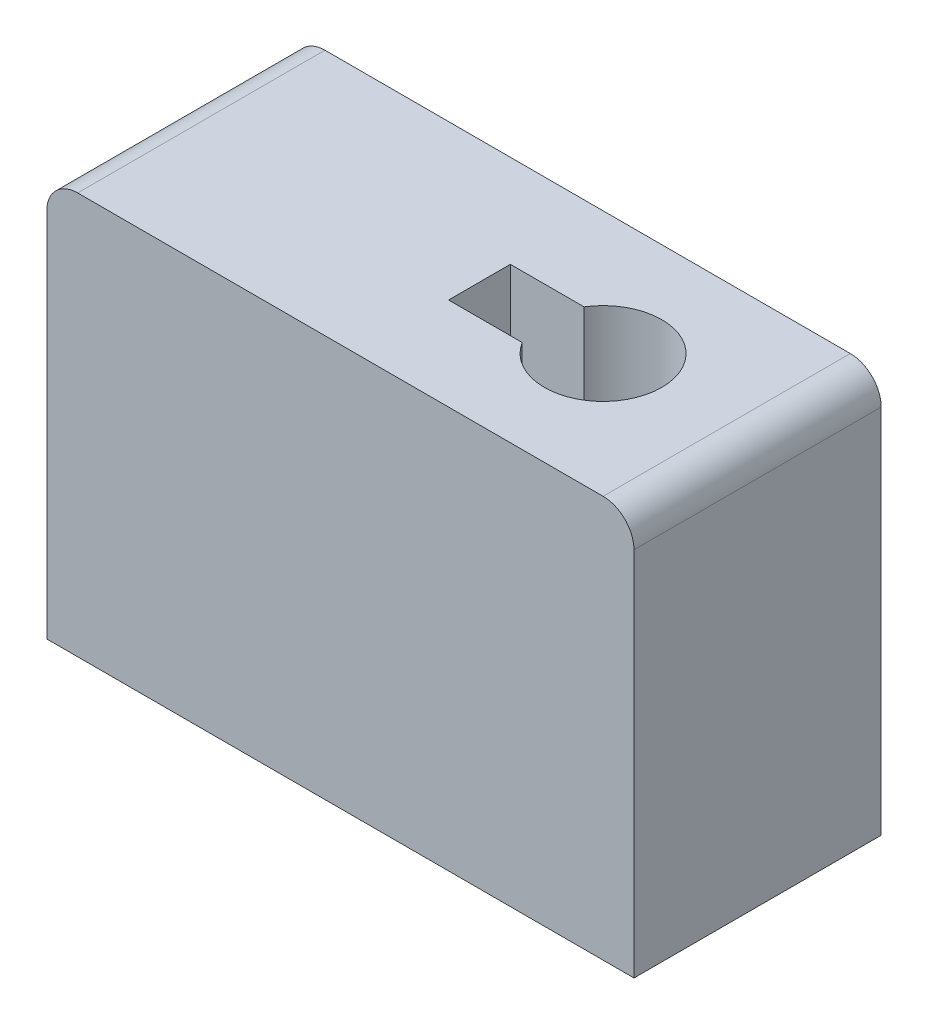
ISO-10303-21;
HEADER;
FILE_DESCRIPTION(('STEP AP214'),'2;1');
FILE_NAME('part.step','',(''),(''),'','','');
FILE_SCHEMA(('AUTOMOTIVE_DESIGN { 1 0 10303 214 1 1 1 1 }'));
ENDSEC;
DATA;
#1=APPLICATION_CONTEXT('core data for automotive mechanical design processes');
#2=APPLICATION_PROTOCOL_DEFINITION('international standard','automotive_design',2000,#1);
#3=PRODUCT_CONTEXT('',#1,'mechanical');
#4=PRODUCT('Part','Part','',(#3));
#5=PRODUCT_RELATED_PRODUCT_CATEGORY('part','',(#4));
#6=PRODUCT_DEFINITION_FORMATION('','',#4);
#7=PRODUCT_DEFINITION_CONTEXT('part definition',#1,'design');
#8=PRODUCT_DEFINITION('design','',#6,#7);
#9=PRODUCT_DEFINITION_SHAPE('','',#8);
#10=(LENGTH_UNIT() NAMED_UNIT(*) SI_UNIT(.MILLI.,.METRE.));
#11=(NAMED_UNIT(*) PLANE_ANGLE_UNIT() SI_UNIT($,.RADIAN.));
#12=(NAMED_UNIT(*) SI_UNIT($,.STERADIAN.) SOLID_ANGLE_UNIT());
#13=UNCERTAINTY_MEASURE_WITH_UNIT(LENGTH_MEASURE(1.E-05),#10,'distance_accuracy_value','');
#14=(GEOMETRIC_REPRESENTATION_CONTEXT(3) GLOBAL_UNCERTAINTY_ASSIGNED_CONTEXT((#13)) GLOBAL_UNIT_ASSIGNED_CONTEXT((#10,
#11,#12)) REPRESENTATION_CONTEXT('',''));
#15=CARTESIAN_POINT('',(0.,0.,0.));
#16=DIRECTION('',(0.,0.,1.));
#17=DIRECTION('',(1.,0.,0.));
#18=AXIS2_PLACEMENT_3D('',#15,#16,#17);
#19=CARTESIAN_POINT('',(0.,0.,0.));
#20=DIRECTION('',(0.,-1.,0.));
#21=DIRECTION('',(0.,0.,-1.));
#22=AXIS2_PLACEMENT_3D('',#19,#20,#21);
#23=PLANE('',#22);
#24=DIRECTION('',(-1.,0.,0.));
#25=VECTOR('',#24,1.);
#26=CARTESIAN_POINT('',(0.,0.,-5.));
#27=LINE('',#26,#25);
#28=CARTESIAN_POINT('',(11.4920127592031,0.,-5.));
#29=VERTEX_POINT('',#28);
#30=CARTESIAN_POINT('',(10.,0.,-5.));
#31=VERTEX_POINT('',#30);
#32=EDGE_CURVE('E130',#29,#31,#27,.T.);
#33=ORIENTED_EDGE('',*,*,#32,.T.);
#34=DIRECTION('',(0.,0.,1.));
#35=VECTOR('',#34,1.);
#36=CARTESIAN_POINT('',(10.,0.,0.));
#37=LINE('',#36,#35);
#38=CARTESIAN_POINT('',(10.,0.,-3.));
#39=VERTEX_POINT('',#38);
#40=EDGE_CURVE('E126',#31,#39,#37,.T.);
#41=ORIENTED_EDGE('',*,*,#40,.T.);
#42=DIRECTION('',(1.,0.,0.));
#43=VECTOR('',#42,1.);
#44=CARTESIAN_POINT('',(0.,0.,-3.));
#45=LINE('',#44,#43);
#46=CARTESIAN_POINT('',(11.4920127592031,0.,-3.));
#47=VERTEX_POINT('',#46);
#48=EDGE_CURVE('E133',#39,#47,#45,.T.);
#49=ORIENTED_EDGE('',*,*,#48,.T.);
#50=CARTESIAN_POINT('',(14.,0.,-4.));
#51=DIRECTION('',(0.,1.,0.));
#52=DIRECTION('',(0.,0.,1.));
#53=AXIS2_PLACEMENT_3D('',#50,#51,#52);
#54=CIRCLE('',#53,2.7);
#55=EDGE_CURVE('E181',#47,#29,#54,.T.);
#56=ORIENTED_EDGE('',*,*,#55,.T.);
#57=EDGE_LOOP('',(#33,#41,#49,#56));
#58=FACE_BOUND('',#57,.T.);
#59=CARTESIAN_POINT('',(5.,0.,-4.));
#60=DIRECTION('',(0.,1.,0.));
#61=DIRECTION('',(0.,0.,1.));
#62=AXIS2_PLACEMENT_3D('',#59,#60,#61);
#63=CIRCLE('',#62,2.7);
#64=CARTESIAN_POINT('',(5.,0.,-1.3));
#65=VERTEX_POINT('',#64);
#66=EDGE_CURVE('E183',#65,#65,#63,.T.);
#67=ORIENTED_EDGE('',*,*,#66,.T.);
#68=EDGE_LOOP('',(#67));
#69=FACE_BOUND('',#68,.T.);
#70=DIRECTION('',(0.,0.,1.));
#71=VECTOR('',#70,1.);
#72=CARTESIAN_POINT('',(0.,0.,0.));
#73=LINE('',#72,#71);
#74=CARTESIAN_POINT('',(0.,0.,-8.));
#75=VERTEX_POINT('',#74);
#76=CARTESIAN_POINT('',(0.,0.,0.));
#77=VERTEX_POINT('',#76);
#78=EDGE_CURVE('E186',#75,#77,#73,.T.);
#79=ORIENTED_EDGE('',*,*,#78,.F.);
#80=DIRECTION('',(-1.,0.,0.));
#81=VECTOR('',#80,1.);
#82=CARTESIAN_POINT('',(0.,0.,-8.));
#83=LINE('',#82,#81);
#84=CARTESIAN_POINT('',(19.,0.,-8.));
#85=VERTEX_POINT('',#84);
#86=EDGE_CURVE('E195',#85,#75,#83,.T.);
#87=ORIENTED_EDGE('',*,*,#86,.F.);
#88=DIRECTION('',(0.,0.,-1.));
#89=VECTOR('',#88,1.);
#90=CARTESIAN_POINT('',(19.,0.,0.));
#91=LINE('',#90,#89);
#92=CARTESIAN_POINT('',(19.,0.,0.));
#93=VERTEX_POINT('',#92);
#94=EDGE_CURVE('E192',#93,#85,#91,.T.);
#95=ORIENTED_EDGE('',*,*,#94,.F.);
#96=DIRECTION('',(1.,0.,0.));
#97=VECTOR('',#96,1.);
#98=CARTESIAN_POINT('',(0.,0.,0.));
#99=LINE('',#98,#97);
#100=EDGE_CURVE('E189',#77,#93,#99,.T.);
#101=ORIENTED_EDGE('',*,*,#100,.F.);
#102=EDGE_LOOP('',(#79,#87,#95,#101));
#103=FACE_BOUND('',#102,.T.);
#104=ADVANCED_FACE('F33',(#58,#69,#103),#23,.T.);
#105=CARTESIAN_POINT('',(0.,10.,0.));
#106=DIRECTION('',(1.,0.,0.));
#107=DIRECTION('',(0.,0.,-1.));
#108=AXIS2_PLACEMENT_3D('',#105,#106,#107);
#109=PLANE('',#108);
#110=DIRECTION('',(0.,-1.,0.));
#111=VECTOR('',#110,1.);
#112=CARTESIAN_POINT('',(0.,10.,0.));
#113=LINE('',#112,#111);
#114=CARTESIAN_POINT('',(0.,12.,0.));
#115=VERTEX_POINT('',#114);
#116=EDGE_CURVE('E204',#115,#77,#113,.T.);
#117=ORIENTED_EDGE('',*,*,#116,.F.);
#118=DIRECTION('',(0.,0.,1.));
#119=VECTOR('',#118,1.);
#120=CARTESIAN_POINT('',(0.,12.,-8.));
#121=LINE('',#120,#119);
#122=CARTESIAN_POINT('',(0.,12.,-8.));
#123=VERTEX_POINT('',#122);
#124=EDGE_CURVE('E221',#115,#123,#121,.F.);
#125=ORIENTED_EDGE('',*,*,#124,.T.);
#126=DIRECTION('',(0.,-1.,0.));
#127=VECTOR('',#126,1.);
#128=CARTESIAN_POINT('',(0.,10.,-8.));
#129=LINE('',#128,#127);
#130=EDGE_CURVE('E198',#123,#75,#129,.T.);
#131=ORIENTED_EDGE('',*,*,#130,.T.);
#132=ORIENTED_EDGE('',*,*,#78,.T.);
#133=EDGE_LOOP('',(#117,#125,#131,#132));
#134=FACE_BOUND('',#133,.T.);
#135=ADVANCED_FACE('F259',(#134),#109,.F.);
#136=CARTESIAN_POINT('',(0.,10.,0.));
#137=DIRECTION('',(0.,0.,-1.));
#138=DIRECTION('',(-1.,0.,0.));
#139=AXIS2_PLACEMENT_3D('',#136,#137,#138);
#140=PLANE('',#139);
#141=DIRECTION('',(0.,-1.,0.));
#142=VECTOR('',#141,1.);
#143=CARTESIAN_POINT('',(19.,10.,0.));
#144=LINE('',#143,#142);
#145=CARTESIAN_POINT('',(19.,12.,0.));
#146=VERTEX_POINT('',#145);
#147=EDGE_CURVE('E202',#146,#93,#144,.T.);
#148=ORIENTED_EDGE('',*,*,#147,.F.);
#149=CARTESIAN_POINT('',(18.,12.,0.));
#150=DIRECTION('',(0.,0.,-1.));
#151=DIRECTION('',(-1.,0.,0.));
#152=AXIS2_PLACEMENT_3D('',#149,#150,#151);
#153=CIRCLE('',#152,1.);
#154=CARTESIAN_POINT('',(18.,13.,0.));
#155=VERTEX_POINT('',#154);
#156=EDGE_CURVE('E219',#146,#155,#153,.F.);
#157=ORIENTED_EDGE('',*,*,#156,.T.);
#158=DIRECTION('',(1.,0.,0.));
#159=VECTOR('',#158,1.);
#160=CARTESIAN_POINT('',(0.,13.,0.));
#161=LINE('',#160,#159);
#162=CARTESIAN_POINT('',(1.,13.,0.));
#163=VERTEX_POINT('',#162);
#164=EDGE_CURVE('E172',#163,#155,#161,.T.);
#165=ORIENTED_EDGE('',*,*,#164,.F.);
#166=CARTESIAN_POINT('',(1.,12.,0.));
#167=DIRECTION('',(0.,0.,-1.));
#168=DIRECTION('',(-1.,0.,0.));
#169=AXIS2_PLACEMENT_3D('',#166,#167,#168);
#170=CIRCLE('',#169,1.);
#171=EDGE_CURVE('E56',#163,#115,#170,.F.);
#172=ORIENTED_EDGE('',*,*,#171,.T.);
#173=ORIENTED_EDGE('',*,*,#116,.T.);
#174=ORIENTED_EDGE('',*,*,#100,.T.);
#175=EDGE_LOOP('',(#148,#157,#165,#172,#173,#174));
#176=FACE_BOUND('',#175,.T.);
#177=ADVANCED_FACE('F264',(#176),#140,.F.);
#178=CARTESIAN_POINT('',(19.,10.,0.));
#179=DIRECTION('',(-1.,0.,0.));
#180=DIRECTION('',(0.,0.,1.));
#181=AXIS2_PLACEMENT_3D('',#178,#179,#180);
#182=PLANE('',#181);
#183=DIRECTION('',(0.,-1.,0.));
#184=VECTOR('',#183,1.);
#185=CARTESIAN_POINT('',(19.,10.,-8.));
#186=LINE('',#185,#184);
#187=CARTESIAN_POINT('',(19.,12.,-8.));
#188=VERTEX_POINT('',#187);
#189=EDGE_CURVE('E200',#188,#85,#186,.T.);
#190=ORIENTED_EDGE('',*,*,#189,.F.);
#191=DIRECTION('',(0.,0.,-1.));
#192=VECTOR('',#191,1.);
#193=CARTESIAN_POINT('',(19.,12.,0.));
#194=LINE('',#193,#192);
#195=EDGE_CURVE('E216',#188,#146,#194,.F.);
#196=ORIENTED_EDGE('',*,*,#195,.T.);
#197=ORIENTED_EDGE('',*,*,#147,.T.);
#198=ORIENTED_EDGE('',*,*,#94,.T.);
#199=EDGE_LOOP('',(#190,#196,#197,#198));
#200=FACE_BOUND('',#199,.T.);
#201=ADVANCED_FACE('F270',(#200),#182,.F.);
#202=CARTESIAN_POINT('',(0.,10.,-8.));
#203=DIRECTION('',(0.,0.,1.));
#204=DIRECTION('',(1.,0.,0.));
#205=AXIS2_PLACEMENT_3D('',#202,#203,#204);
#206=PLANE('',#205);
#207=DIRECTION('',(-1.,0.,0.));
#208=VECTOR('',#207,1.);
#209=CARTESIAN_POINT('',(19.,13.,-8.));
#210=LINE('',#209,#208);
#211=CARTESIAN_POINT('',(18.,13.,-8.));
#212=VERTEX_POINT('',#211);
#213=CARTESIAN_POINT('',(0.999999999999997,13.,-8.));
#214=VERTEX_POINT('',#213);
#215=EDGE_CURVE('E169',#212,#214,#210,.T.);
#216=ORIENTED_EDGE('',*,*,#215,.F.);
#217=CARTESIAN_POINT('',(18.,12.,-8.));
#218=DIRECTION('',(0.,0.,1.));
#219=DIRECTION('',(1.,0.,0.));
#220=AXIS2_PLACEMENT_3D('',#217,#218,#219);
#221=CIRCLE('',#220,1.);
#222=EDGE_CURVE('E214',#212,#188,#221,.F.);
#223=ORIENTED_EDGE('',*,*,#222,.T.);
#224=ORIENTED_EDGE('',*,*,#189,.T.);
#225=ORIENTED_EDGE('',*,*,#86,.T.);
#226=ORIENTED_EDGE('',*,*,#130,.F.);
#227=CARTESIAN_POINT('',(0.999999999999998,12.,-8.));
#228=DIRECTION('',(0.,0.,1.));
#229=DIRECTION('',(1.,0.,0.));
#230=AXIS2_PLACEMENT_3D('',#227,#228,#229);
#231=CIRCLE('',#230,1.);
#232=EDGE_CURVE('E212',#123,#214,#231,.F.);
#233=ORIENTED_EDGE('',*,*,#232,.T.);
#234=EDGE_LOOP('',(#216,#223,#224,#225,#226,#233));
#235=FACE_BOUND('',#234,.T.);
#236=ADVANCED_FACE('F254',(#235),#206,.F.);
#237=CARTESIAN_POINT('',(5.,10.,-4.));
#238=DIRECTION('',(0.,-1.,0.));
#239=DIRECTION('',(0.,0.,-1.));
#240=AXIS2_PLACEMENT_3D('',#237,#238,#239);
#241=CYLINDRICAL_SURFACE('',#240,2.7);
#242=CARTESIAN_POINT('',(5.,10.,-4.));
#243=DIRECTION('',(0.,1.,0.));
#244=DIRECTION('',(0.,0.,1.));
#245=AXIS2_PLACEMENT_3D('',#242,#243,#244);
#246=CIRCLE('',#245,2.7);
#247=CARTESIAN_POINT('',(5.,10.,-1.3));
#248=VERTEX_POINT('',#247);
#249=EDGE_CURVE('E178',#248,#248,#246,.T.);
#250=ORIENTED_EDGE('',*,*,#249,.T.);
#251=EDGE_LOOP('',(#250));
#252=FACE_BOUND('',#251,.T.);
#253=ORIENTED_EDGE('',*,*,#66,.F.);
#254=EDGE_LOOP('',(#253));
#255=FACE_BOUND('',#254,.T.);
#256=ADVANCED_FACE('F247',(#252,#255),#241,.F.);
#257=CARTESIAN_POINT('',(14.,10.,-4.));
#258=DIRECTION('',(0.,-1.,0.));
#259=DIRECTION('',(0.,0.,-1.));
#260=AXIS2_PLACEMENT_3D('',#257,#258,#259);
#261=CYLINDRICAL_SURFACE('',#260,2.7);
#262=DIRECTION('',(0.,-1.,0.));
#263=VECTOR('',#262,1.);
#264=CARTESIAN_POINT('',(11.4920127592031,10.,-5.));
#265=LINE('',#264,#263);
#266=CARTESIAN_POINT('',(11.4920127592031,10.,-5.));
#267=VERTEX_POINT('',#266);
#268=EDGE_CURVE('E156',#29,#267,#265,.F.);
#269=ORIENTED_EDGE('',*,*,#268,.F.);
#270=ORIENTED_EDGE('',*,*,#55,.F.);
#271=DIRECTION('',(0.,-1.,0.));
#272=VECTOR('',#271,1.);
#273=CARTESIAN_POINT('',(11.4920127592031,10.,-3.));
#274=LINE('',#273,#272);
#275=CARTESIAN_POINT('',(11.4920127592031,10.,-3.));
#276=VERTEX_POINT('',#275);
#277=EDGE_CURVE('E136',#276,#47,#274,.T.);
#278=ORIENTED_EDGE('',*,*,#277,.F.);
#279=CARTESIAN_POINT('',(14.,10.,-4.));
#280=DIRECTION('',(0.,1.,0.));
#281=DIRECTION('',(0.,0.,1.));
#282=AXIS2_PLACEMENT_3D('',#279,#280,#281);
#283=CIRCLE('',#282,2.7);
#284=EDGE_CURVE('E175',#276,#267,#283,.T.);
#285=ORIENTED_EDGE('',*,*,#284,.T.);
#286=EDGE_LOOP('',(#269,#270,#278,#285));
#287=FACE_BOUND('',#286,.T.);
#288=ADVANCED_FACE('F245',(#287),#261,.F.);
#289=CARTESIAN_POINT('',(14.,13.,-4.));
#290=DIRECTION('',(0.,-1.,0.));
#291=DIRECTION('',(0.,0.,-1.));
#292=AXIS2_PLACEMENT_3D('',#289,#290,#291);
#293=CYLINDRICAL_SURFACE('',#292,1.9);
#294=DIRECTION('',(0.,1.,0.));
#295=VECTOR('',#294,1.);
#296=CARTESIAN_POINT('',(12.3844505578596,0.,-5.));
#297=LINE('',#296,#295);
#298=CARTESIAN_POINT('',(12.3844505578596,10.,-5.));
#299=VERTEX_POINT('',#298);
#300=CARTESIAN_POINT('',(12.3844505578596,13.,-5.));
#301=VERTEX_POINT('',#300);
#302=EDGE_CURVE('E146',#299,#301,#297,.T.);
#303=ORIENTED_EDGE('',*,*,#302,.F.);
#304=CARTESIAN_POINT('',(14.,10.,-4.));
#305=DIRECTION('',(0.,1.,0.));
#306=DIRECTION('',(0.,0.,1.));
#307=AXIS2_PLACEMENT_3D('',#304,#305,#306);
#308=CIRCLE('',#307,1.9);
#309=CARTESIAN_POINT('',(12.3844505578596,10.,-3.));
#310=VERTEX_POINT('',#309);
#311=EDGE_CURVE('E163',#310,#299,#308,.T.);
#312=ORIENTED_EDGE('',*,*,#311,.F.);
#313=DIRECTION('',(0.,1.,0.));
#314=VECTOR('',#313,1.);
#315=CARTESIAN_POINT('',(12.3844505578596,0.,-3.));
#316=LINE('',#315,#314);
#317=CARTESIAN_POINT('',(12.3844505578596,13.,-3.));
#318=VERTEX_POINT('',#317);
#319=EDGE_CURVE('E48',#310,#318,#316,.T.);
#320=ORIENTED_EDGE('',*,*,#319,.T.);
#321=CARTESIAN_POINT('',(14.,13.,-4.));
#322=DIRECTION('',(0.,1.,0.));
#323=DIRECTION('',(0.,0.,1.));
#324=AXIS2_PLACEMENT_3D('',#321,#322,#323);
#325=CIRCLE('',#324,1.9);
#326=EDGE_CURVE('E168',#318,#301,#325,.T.);
#327=ORIENTED_EDGE('',*,*,#326,.T.);
#328=EDGE_LOOP('',(#303,#312,#320,#327));
#329=FACE_BOUND('',#328,.T.);
#330=ADVANCED_FACE('F232',(#329),#293,.F.);
#331=CARTESIAN_POINT('',(0.,13.,0.));
#332=DIRECTION('',(0.,1.,0.));
#333=DIRECTION('',(0.,0.,1.));
#334=AXIS2_PLACEMENT_3D('',#331,#332,#333);
#335=PLANE('',#334);
#336=DIRECTION('',(-1.,0.,0.));
#337=VECTOR('',#336,1.);
#338=CARTESIAN_POINT('',(0.,13.,-5.));
#339=LINE('',#338,#337);
#340=CARTESIAN_POINT('',(10.,13.,-5.));
#341=VERTEX_POINT('',#340);
#342=EDGE_CURVE('E161',#301,#341,#339,.T.);
#343=ORIENTED_EDGE('',*,*,#342,.F.);
#344=ORIENTED_EDGE('',*,*,#326,.F.);
#345=DIRECTION('',(1.,0.,0.));
#346=VECTOR('',#345,1.);
#347=CARTESIAN_POINT('',(0.,13.,-3.));
#348=LINE('',#347,#346);
#349=CARTESIAN_POINT('',(10.,13.,-3.));
#350=VERTEX_POINT('',#349);
#351=EDGE_CURVE('E154',#350,#318,#348,.T.);
#352=ORIENTED_EDGE('',*,*,#351,.F.);
#353=DIRECTION('',(0.,0.,1.));
#354=VECTOR('',#353,1.);
#355=CARTESIAN_POINT('',(10.,13.,0.));
#356=LINE('',#355,#354);
#357=EDGE_CURVE('E11',#341,#350,#356,.T.);
#358=ORIENTED_EDGE('',*,*,#357,.F.);
#359=EDGE_LOOP('',(#343,#344,#352,#358));
#360=FACE_BOUND('',#359,.T.);
#361=ORIENTED_EDGE('',*,*,#164,.T.);
#362=DIRECTION('',(0.,0.,-1.));
#363=VECTOR('',#362,1.);
#364=CARTESIAN_POINT('',(18.,13.,-8.));
#365=LINE('',#364,#363);
#366=EDGE_CURVE('E209',#155,#212,#365,.T.);
#367=ORIENTED_EDGE('',*,*,#366,.T.);
#368=ORIENTED_EDGE('',*,*,#215,.T.);
#369=DIRECTION('',(0.,0.,1.));
#370=VECTOR('',#369,1.);
#371=CARTESIAN_POINT('',(1.,13.,0.));
#372=LINE('',#371,#370);
#373=EDGE_CURVE('E206',#214,#163,#372,.T.);
#374=ORIENTED_EDGE('',*,*,#373,.T.);
#375=EDGE_LOOP('',(#361,#367,#368,#374));
#376=FACE_BOUND('',#375,.T.);
#377=ADVANCED_FACE('F236',(#360,#376),#335,.T.);
#378=CARTESIAN_POINT('',(0.,10.,0.));
#379=DIRECTION('',(0.,1.,0.));
#380=DIRECTION('',(0.,0.,1.));
#381=AXIS2_PLACEMENT_3D('',#378,#379,#380);
#382=PLANE('',#381);
#383=ORIENTED_EDGE('',*,*,#311,.T.);
#384=DIRECTION('',(-1.,0.,0.));
#385=VECTOR('',#384,1.);
#386=CARTESIAN_POINT('',(0.,10.,-5.));
#387=LINE('',#386,#385);
#388=EDGE_CURVE('E41',#299,#267,#387,.T.);
#389=ORIENTED_EDGE('',*,*,#388,.T.);
#390=ORIENTED_EDGE('',*,*,#284,.F.);
#391=DIRECTION('',(1.,0.,0.));
#392=VECTOR('',#391,1.);
#393=CARTESIAN_POINT('',(0.,10.,-3.));
#394=LINE('',#393,#392);
#395=EDGE_CURVE('E223',#276,#310,#394,.T.);
#396=ORIENTED_EDGE('',*,*,#395,.T.);
#397=EDGE_LOOP('',(#383,#389,#390,#396));
#398=FACE_BOUND('',#397,.T.);
#399=ADVANCED_FACE('F243',(#398),#382,.F.);
#400=ORIENTED_EDGE('',*,*,#249,.F.);
#401=EDGE_LOOP('',(#400));
#402=FACE_BOUND('',#401,.T.);
#403=ADVANCED_FACE('F278',(#402),#382,.F.);
#404=CARTESIAN_POINT('',(18.,12.,0.));
#405=DIRECTION('',(0.,0.,1.));
#406=DIRECTION('',(1.,0.,0.));
#407=AXIS2_PLACEMENT_3D('',#404,#405,#406);
#408=CYLINDRICAL_SURFACE('',#407,1.);
#409=ORIENTED_EDGE('',*,*,#156,.F.);
#410=ORIENTED_EDGE('',*,*,#195,.F.);
#411=ORIENTED_EDGE('',*,*,#222,.F.);
#412=ORIENTED_EDGE('',*,*,#366,.F.);
#413=EDGE_LOOP('',(#409,#410,#411,#412));
#414=FACE_BOUND('',#413,.T.);
#415=ADVANCED_FACE('F276',(#414),#408,.T.);
#416=CARTESIAN_POINT('',(1.,12.,0.));
#417=DIRECTION('',(0.,0.,-1.));
#418=DIRECTION('',(-1.,0.,0.));
#419=AXIS2_PLACEMENT_3D('',#416,#417,#418);
#420=CYLINDRICAL_SURFACE('',#419,1.);
#421=ORIENTED_EDGE('',*,*,#232,.F.);
#422=ORIENTED_EDGE('',*,*,#124,.F.);
#423=ORIENTED_EDGE('',*,*,#171,.F.);
#424=ORIENTED_EDGE('',*,*,#373,.F.);
#425=EDGE_LOOP('',(#421,#422,#423,#424));
#426=FACE_BOUND('',#425,.T.);
#427=ADVANCED_FACE('F35',(#426),#420,.T.);
#428=CARTESIAN_POINT('',(10.,0.,0.));
#429=DIRECTION('',(-1.,0.,0.));
#430=DIRECTION('',(0.,0.,1.));
#431=AXIS2_PLACEMENT_3D('',#428,#429,#430);
#432=PLANE('',#431);
#433=ORIENTED_EDGE('',*,*,#357,.T.);
#434=DIRECTION('',(0.,1.,0.));
#435=VECTOR('',#434,1.);
#436=CARTESIAN_POINT('',(10.,0.,-3.));
#437=LINE('',#436,#435);
#438=EDGE_CURVE('E121',#39,#350,#437,.T.);
#439=ORIENTED_EDGE('',*,*,#438,.F.);
#440=ORIENTED_EDGE('',*,*,#40,.F.);
#441=DIRECTION('',(0.,1.,0.));
#442=VECTOR('',#441,1.);
#443=CARTESIAN_POINT('',(10.,0.,-5.));
#444=LINE('',#443,#442);
#445=EDGE_CURVE('E145',#31,#341,#444,.T.);
#446=ORIENTED_EDGE('',*,*,#445,.T.);
#447=EDGE_LOOP('',(#433,#439,#440,#446));
#448=FACE_BOUND('',#447,.T.);
#449=ADVANCED_FACE('F123',(#448),#432,.F.);
#450=CARTESIAN_POINT('',(0.,0.,-5.));
#451=DIRECTION('',(0.,0.,-1.));
#452=DIRECTION('',(-1.,0.,0.));
#453=AXIS2_PLACEMENT_3D('',#450,#451,#452);
#454=PLANE('',#453);
#455=ORIENTED_EDGE('',*,*,#342,.T.);
#456=ORIENTED_EDGE('',*,*,#445,.F.);
#457=ORIENTED_EDGE('',*,*,#32,.F.);
#458=ORIENTED_EDGE('',*,*,#268,.T.);
#459=ORIENTED_EDGE('',*,*,#388,.F.);
#460=ORIENTED_EDGE('',*,*,#302,.T.);
#461=EDGE_LOOP('',(#455,#456,#457,#458,#459,#460));
#462=FACE_BOUND('',#461,.T.);
#463=ADVANCED_FACE('F239',(#462),#454,.F.);
#464=CARTESIAN_POINT('',(0.,0.,-3.));
#465=DIRECTION('',(0.,0.,1.));
#466=DIRECTION('',(1.,0.,0.));
#467=AXIS2_PLACEMENT_3D('',#464,#465,#466);
#468=PLANE('',#467);
#469=ORIENTED_EDGE('',*,*,#351,.T.);
#470=ORIENTED_EDGE('',*,*,#319,.F.);
#471=ORIENTED_EDGE('',*,*,#395,.F.);
#472=ORIENTED_EDGE('',*,*,#277,.T.);
#473=ORIENTED_EDGE('',*,*,#48,.F.);
#474=ORIENTED_EDGE('',*,*,#438,.T.);
#475=EDGE_LOOP('',(#469,#470,#471,#472,#473,#474));
#476=FACE_BOUND('',#475,.T.);
#477=ADVANCED_FACE('F134',(#476),#468,.F.);
#478=CLOSED_SHELL('',(#104,#135,#177,#201,#236,#256,#288,#330,#377,#399,#403,#415,#427,#449,
#463,#477));
#479=MANIFOLD_SOLID_BREP('B2',#478);
#480=ADVANCED_BREP_SHAPE_REPRESENTATION('',(#18,#479),#14);
#481=SHAPE_DEFINITION_REPRESENTATION(#9,#480);
ENDSEC;
END-ISO-10303-21;
